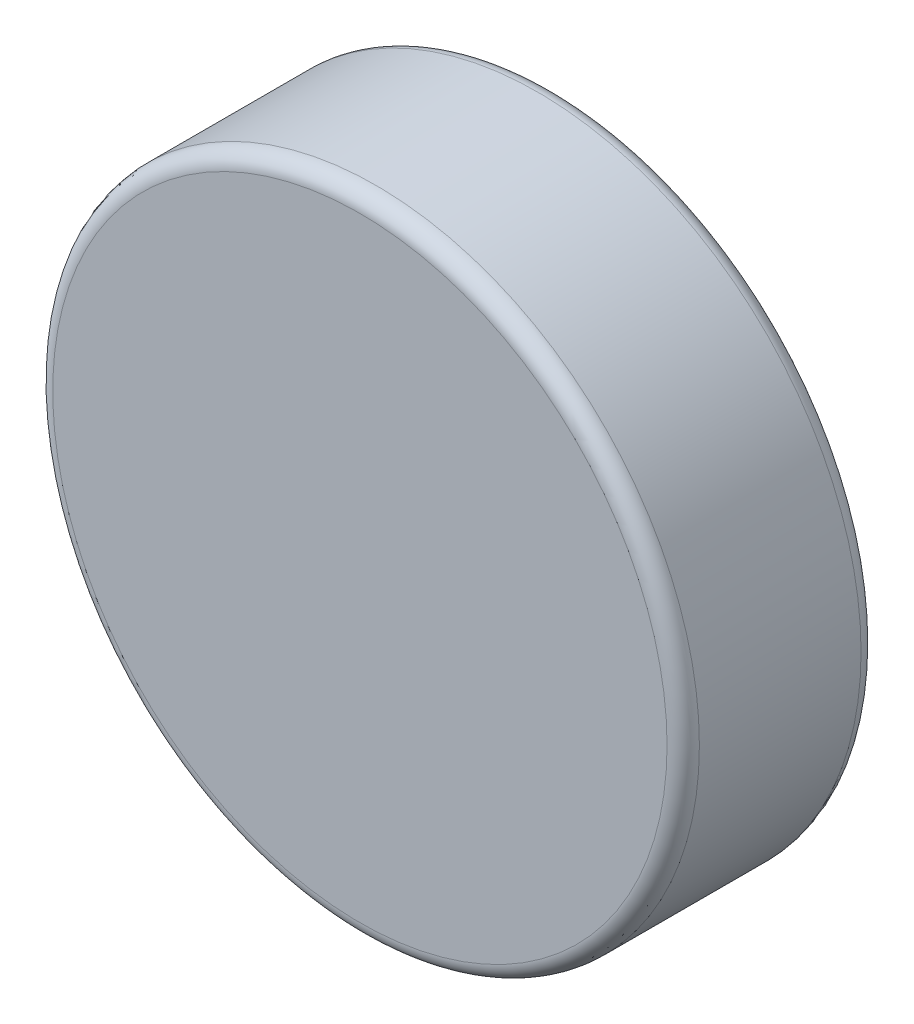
from build123d import *

# Parameters (mm, degrees)
ESQUISSE1_R        = 5
BOSS_EXTRU_1_DEPTH = 3
CONG_1_R           = 0.25


with BuildPart() as part:
    # Esquisse1 → Boss.-Extru.1 (new body)
    with BuildSketch(Plane.XY):
        Circle(ESQUISSE1_R)
    extrude(amount=BOSS_EXTRU_1_DEPTH)

    # Cong_1
    cong_1_edges = [part.edges().sort_by_distance(p)[0] for p in [
        (-5, 0, 0),
        (-5, 0, 3),
    ]]
    fillet(cong_1_edges, radius=CONG_1_R)


solid = part.part
